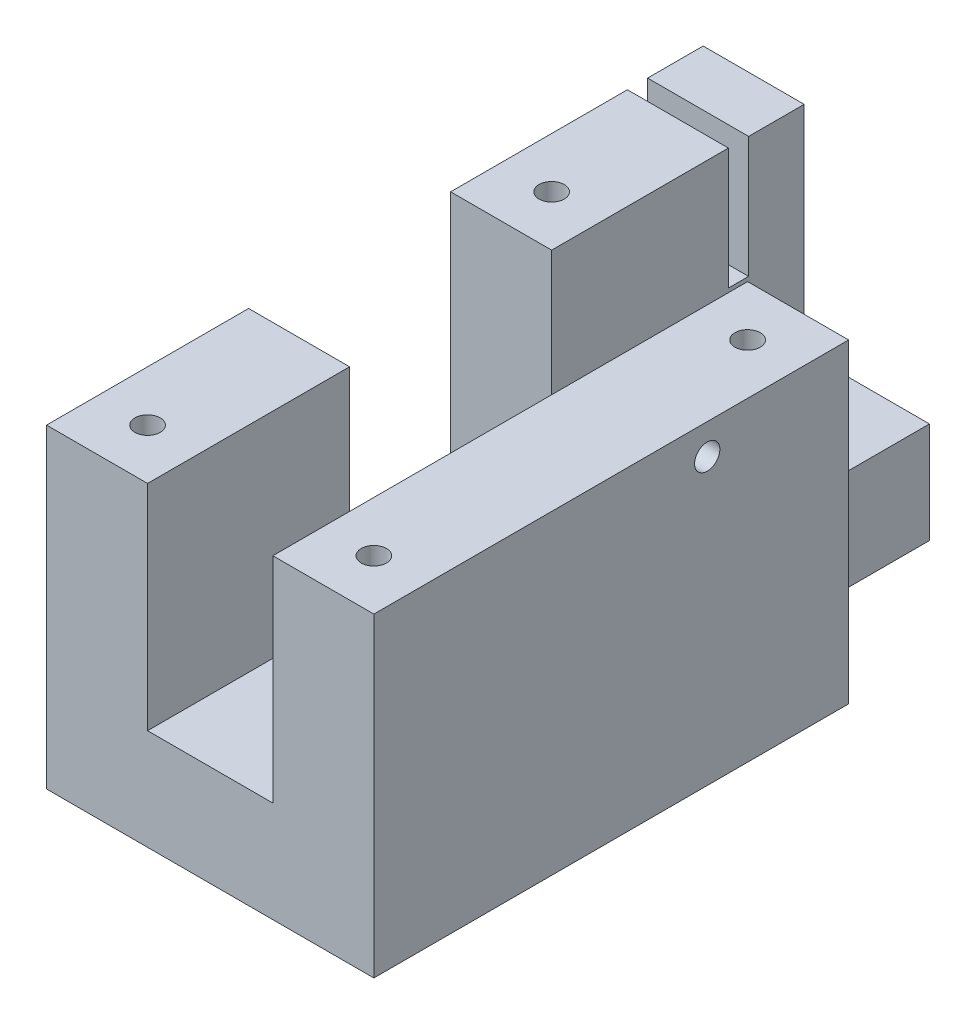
from build123d import *

# Parameters (mm, degrees)
EXTRUDE_1_DEPTH     = 65
SKETCH_2_OUTSIDE_W  = 82.81
SKETCH_2_OUTSIDE_H  = 49.01
SKETCH_2_OUTSIDE_R  = 1.25
CUT_EXTRUDE_1_DEPTH = 57.5
SKETCH_3_OUTSIDE_W  = 50.21
SKETCH_3_OUTSIDE_H  = 82.81
CUT_EXTRUDE_2_DEPTH = 57.5
SKETCH_4_R          = 1.25
CUT_EXTRUDE_3_DEPTH = 12
SKETCH_6_R          = 2.1
CUT_EXTRUDE_4_DEPTH = 12


with BuildPart() as part:
    # Sketch 1 → Extrude 1 (new body)
    with BuildSketch(Plane.XY):
        Polygon((10, 10), (22.4, 10), (22.4, 31.2), (32.4, 31.2), (32.4, 0), (0, 0), (0, 31.2), (10, 31.2), align=None)
    extrude(amount=EXTRUDE_1_DEPTH)

    # Sketch 2 outside → Cut-Extrude 1 (cut)
    # profile 1 of 2: a face of its own
    with BuildSketch(Plane(origin=(32.4, 0, 0), x_dir=(0, 0, -1), z_dir=(1, 0, 0))):
        with Locations((-32.5, 15.6)):
            Rectangle(SKETCH_2_OUTSIDE_W, SKETCH_2_OUTSIDE_H)
        Polygon((0, 0), (0, 31.2), (-5.5, 31.2), (-5.5, 19.2), (-7.5, 19.2), (-7.5, 31.2), (-65, 31.2), (-65, 0), align=None, mode=Mode.SUBTRACT)
    # profile 2 of 2: a face of its own
    with BuildSketch(Plane(origin=(32.4, 0, 0), x_dir=(0, 0, -1), z_dir=(1, 0, 0))):
        with Locations((-32, 28.2)):
            Circle(SKETCH_2_OUTSIDE_R)
    extrude(amount=-CUT_EXTRUDE_1_DEPTH, mode=Mode.SUBTRACT)

    # Sketch 3 outside → Cut-Extrude 2 (cut)
    with BuildSketch(Plane(origin=(0, 31.2, 0), x_dir=(1, 0, 0), z_dir=(0, 1, 0))):
        with Locations((16.2, -32.5)):
            Rectangle(SKETCH_3_OUTSIDE_W, SKETCH_3_OUTSIDE_H)
        Polygon((10, -45), (10, -25), (0, -25), (0, 0), (22.4, 0), (22.4, -18), (32.4, -18), (32.4, -65), (0, -65), (0, -45), align=None, mode=Mode.SUBTRACT)
    extrude(amount=-CUT_EXTRUDE_2_DEPTH, mode=Mode.SUBTRACT)

    # Sketch 4 → Cut-Extrude 3 (cut)
    with BuildSketch(Plane(origin=(0, 31.2, 0), x_dir=(1, 0, 0), z_dir=(0, 1, 0))):
        with Locations(Location((27.4, -23, 0), (0, 0, 270))):
            Circle(SKETCH_4_R)
        with Locations(Location((27.4, -60, 0), (0, 0, 270))):
            Circle(SKETCH_4_R)
        with Locations(Location((5, -60, 0), (0, 0, 270))):
            Circle(SKETCH_4_R)
        with Locations(Location((5, -20, 0), (0, 0, 270))):
            Circle(SKETCH_4_R)
    extrude(amount=-CUT_EXTRUDE_3_DEPTH, mode=Mode.SUBTRACT)

    # Sketch 6 → Cut-Extrude 4 (cut)
    with BuildSketch(Plane.XZ):
        with Locations(Location((5, 50, 0), (0, 0, 270))):
            Circle(SKETCH_6_R)
        with Locations(Location((27.4, 50, 0), (0, 0, 270))):
            Circle(SKETCH_6_R)
    extrude(amount=-CUT_EXTRUDE_4_DEPTH, mode=Mode.SUBTRACT)


solid = part.part
